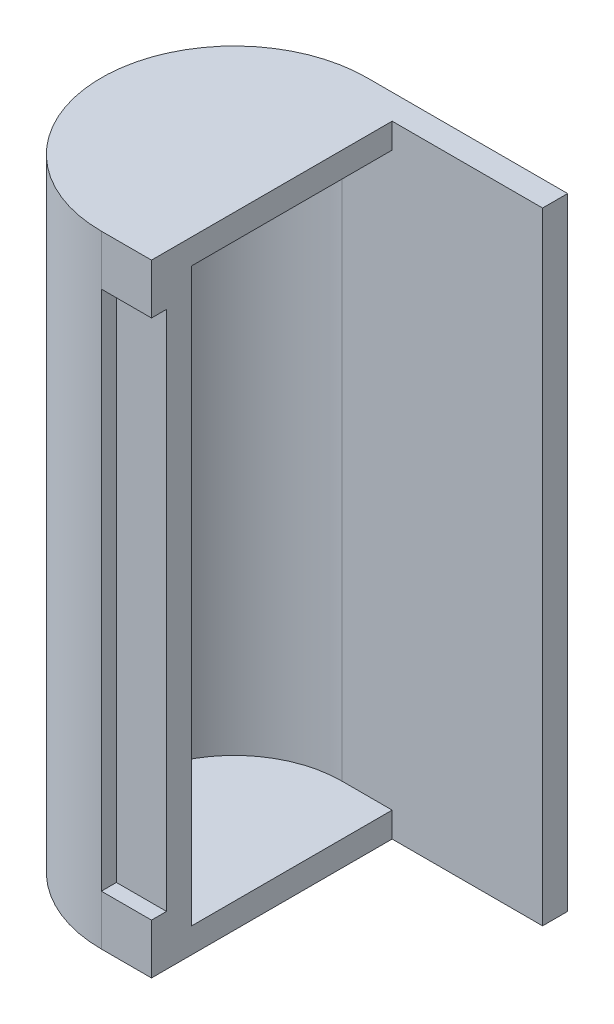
ISO-10303-21;
HEADER;
FILE_DESCRIPTION(('STEP AP214'),'2;1');
FILE_NAME('part.step','',(''),(''),'','','');
FILE_SCHEMA(('AUTOMOTIVE_DESIGN { 1 0 10303 214 1 1 1 1 }'));
ENDSEC;
DATA;
#1=APPLICATION_CONTEXT('core data for automotive mechanical design processes');
#2=APPLICATION_PROTOCOL_DEFINITION('international standard','automotive_design',2000,#1);
#3=PRODUCT_CONTEXT('',#1,'mechanical');
#4=PRODUCT('Part','Part','',(#3));
#5=PRODUCT_RELATED_PRODUCT_CATEGORY('part','',(#4));
#6=PRODUCT_DEFINITION_FORMATION('','',#4);
#7=PRODUCT_DEFINITION_CONTEXT('part definition',#1,'design');
#8=PRODUCT_DEFINITION('design','',#6,#7);
#9=PRODUCT_DEFINITION_SHAPE('','',#8);
#10=(LENGTH_UNIT() NAMED_UNIT(*) SI_UNIT(.MILLI.,.METRE.));
#11=(NAMED_UNIT(*) PLANE_ANGLE_UNIT() SI_UNIT($,.RADIAN.));
#12=(NAMED_UNIT(*) SI_UNIT($,.STERADIAN.) SOLID_ANGLE_UNIT());
#13=UNCERTAINTY_MEASURE_WITH_UNIT(LENGTH_MEASURE(1.E-05),#10,'distance_accuracy_value','');
#14=(GEOMETRIC_REPRESENTATION_CONTEXT(3) GLOBAL_UNCERTAINTY_ASSIGNED_CONTEXT((#13)) GLOBAL_UNIT_ASSIGNED_CONTEXT((#10,
#11,#12)) REPRESENTATION_CONTEXT('',''));
#15=CARTESIAN_POINT('',(0.,0.,0.));
#16=DIRECTION('',(0.,0.,1.));
#17=DIRECTION('',(1.,0.,0.));
#18=AXIS2_PLACEMENT_3D('',#15,#16,#17);
#19=CARTESIAN_POINT('',(-24.3261331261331,-109.594405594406,26.5));
#20=DIRECTION('',(0.,1.,0.));
#21=DIRECTION('',(0.,0.,1.));
#22=AXIS2_PLACEMENT_3D('',#19,#20,#21);
#23=CYLINDRICAL_SURFACE('',#22,21.5);
#24=DIRECTION('',(0.,1.,0.));
#25=VECTOR('',#24,1.);
#26=CARTESIAN_POINT('',(-24.3261331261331,-109.594405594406,48.));
#27=LINE('',#26,#25);
#28=CARTESIAN_POINT('',(-24.3261331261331,-104.594405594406,48.));
#29=VERTEX_POINT('',#28);
#30=CARTESIAN_POINT('',(-24.3261331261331,9.4055944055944,48.));
#31=VERTEX_POINT('',#30);
#32=EDGE_CURVE('E235',#29,#31,#27,.T.);
#33=ORIENTED_EDGE('',*,*,#32,.F.);
#34=CARTESIAN_POINT('',(-24.3261331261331,-104.594405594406,26.5));
#35=DIRECTION('',(0.,-1.,0.));
#36=DIRECTION('',(0.,0.,-1.));
#37=AXIS2_PLACEMENT_3D('',#34,#35,#36);
#38=CIRCLE('',#37,21.5);
#39=CARTESIAN_POINT('',(-24.3261331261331,-104.594405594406,5.));
#40=VERTEX_POINT('',#39);
#41=EDGE_CURVE('E282',#29,#40,#38,.T.);
#42=ORIENTED_EDGE('',*,*,#41,.T.);
#43=DIRECTION('',(0.,-1.,0.));
#44=VECTOR('',#43,1.);
#45=CARTESIAN_POINT('',(-24.3261331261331,14.4055944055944,5.));
#46=LINE('',#45,#44);
#47=CARTESIAN_POINT('',(-24.3261331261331,9.40559440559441,5.));
#48=VERTEX_POINT('',#47);
#49=EDGE_CURVE('E165',#48,#40,#46,.T.);
#50=ORIENTED_EDGE('',*,*,#49,.F.);
#51=CARTESIAN_POINT('',(-24.3261331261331,9.40559440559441,26.5));
#52=DIRECTION('',(0.,1.,0.));
#53=DIRECTION('',(0.,0.,1.));
#54=AXIS2_PLACEMENT_3D('',#51,#52,#53);
#55=CIRCLE('',#54,21.5);
#56=EDGE_CURVE('E181',#48,#31,#55,.T.);
#57=ORIENTED_EDGE('',*,*,#56,.T.);
#58=EDGE_LOOP('',(#33,#42,#50,#57));
#59=FACE_BOUND('',#58,.T.);
#60=ADVANCED_FACE('F37',(#59),#23,.F.);
#61=CARTESIAN_POINT('',(-24.3261331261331,14.4055944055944,45.));
#62=DIRECTION('',(-1.,0.,0.));
#63=DIRECTION('',(0.,0.,1.));
#64=AXIS2_PLACEMENT_3D('',#61,#62,#63);
#65=PLANE('',#64);
#66=DIRECTION('',(0.,-1.,0.));
#67=VECTOR('',#66,1.);
#68=CARTESIAN_POINT('',(-24.3261331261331,14.4055944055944,45.));
#69=LINE('',#68,#67);
#70=CARTESIAN_POINT('',(-24.3261331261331,9.4055944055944,45.));
#71=VERTEX_POINT('',#70);
#72=CARTESIAN_POINT('',(-24.3261331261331,-104.594405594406,45.));
#73=VERTEX_POINT('',#72);
#74=EDGE_CURVE('E217',#71,#73,#69,.T.);
#75=ORIENTED_EDGE('',*,*,#74,.T.);
#76=DIRECTION('',(0.,0.,1.));
#77=VECTOR('',#76,1.);
#78=CARTESIAN_POINT('',(-24.3261331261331,-104.594405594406,45.));
#79=LINE('',#78,#77);
#80=EDGE_CURVE('E52',#73,#29,#79,.T.);
#81=ORIENTED_EDGE('',*,*,#80,.T.);
#82=ORIENTED_EDGE('',*,*,#32,.T.);
#83=DIRECTION('',(0.,0.,-1.));
#84=VECTOR('',#83,1.);
#85=CARTESIAN_POINT('',(-24.3261331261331,9.4055944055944,45.));
#86=LINE('',#85,#84);
#87=EDGE_CURVE('E174',#31,#71,#86,.T.);
#88=ORIENTED_EDGE('',*,*,#87,.T.);
#89=EDGE_LOOP('',(#75,#81,#82,#88));
#90=FACE_BOUND('',#89,.T.);
#91=ADVANCED_FACE('F278',(#90),#65,.T.);
#92=CARTESIAN_POINT('',(0.,0.,45.));
#93=DIRECTION('',(0.,0.,1.));
#94=DIRECTION('',(1.,0.,0.));
#95=AXIS2_PLACEMENT_3D('',#92,#93,#94);
#96=PLANE('',#95);
#97=DIRECTION('',(1.,0.,0.));
#98=VECTOR('',#97,1.);
#99=CARTESIAN_POINT('',(0.,-104.594405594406,45.));
#100=LINE('',#99,#98);
#101=CARTESIAN_POINT('',(-14.3261331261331,-104.594405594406,45.));
#102=VERTEX_POINT('',#101);
#103=EDGE_CURVE('E60',#73,#102,#100,.T.);
#104=ORIENTED_EDGE('',*,*,#103,.F.);
#105=ORIENTED_EDGE('',*,*,#74,.F.);
#106=DIRECTION('',(-1.,0.,0.));
#107=VECTOR('',#106,1.);
#108=CARTESIAN_POINT('',(0.,9.4055944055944,45.));
#109=LINE('',#108,#107);
#110=CARTESIAN_POINT('',(-14.3261331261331,9.4055944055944,45.));
#111=VERTEX_POINT('',#110);
#112=EDGE_CURVE('E11',#111,#71,#109,.T.);
#113=ORIENTED_EDGE('',*,*,#112,.F.);
#114=DIRECTION('',(0.,1.,0.));
#115=VECTOR('',#114,1.);
#116=CARTESIAN_POINT('',(-14.3261331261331,14.4055944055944,45.));
#117=LINE('',#116,#115);
#118=EDGE_CURVE('E219',#102,#111,#117,.T.);
#119=ORIENTED_EDGE('',*,*,#118,.F.);
#120=EDGE_LOOP('',(#104,#105,#113,#119));
#121=FACE_BOUND('',#120,.T.);
#122=ADVANCED_FACE('F277',(#121),#96,.F.);
#123=CARTESIAN_POINT('',(-14.3261331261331,14.4055944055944,53.));
#124=DIRECTION('',(0.,0.,-1.));
#125=DIRECTION('',(-1.,0.,0.));
#126=AXIS2_PLACEMENT_3D('',#123,#124,#125);
#127=PLANE('',#126);
#128=DIRECTION('',(-1.,0.,0.));
#129=VECTOR('',#128,1.);
#130=CARTESIAN_POINT('',(-14.3261331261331,14.4055944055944,53.));
#131=LINE('',#130,#129);
#132=CARTESIAN_POINT('',(-14.3261331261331,14.4055944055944,53.));
#133=VERTEX_POINT('',#132);
#134=CARTESIAN_POINT('',(-24.3261331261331,14.4055944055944,53.));
#135=VERTEX_POINT('',#134);
#136=EDGE_CURVE('E223',#133,#135,#131,.T.);
#137=ORIENTED_EDGE('',*,*,#136,.T.);
#138=DIRECTION('',(0.,1.,0.));
#139=VECTOR('',#138,1.);
#140=CARTESIAN_POINT('',(-24.3261331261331,-109.594405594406,53.));
#141=LINE('',#140,#139);
#142=CARTESIAN_POINT('',(-24.3261331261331,4.4055944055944,53.));
#143=VERTEX_POINT('',#142);
#144=EDGE_CURVE('E232',#143,#135,#141,.T.);
#145=ORIENTED_EDGE('',*,*,#144,.F.);
#146=DIRECTION('',(1.,0.,0.));
#147=VECTOR('',#146,1.);
#148=CARTESIAN_POINT('',(-14.3261331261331,4.4055944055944,53.));
#149=LINE('',#148,#147);
#150=CARTESIAN_POINT('',(-14.3261331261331,4.4055944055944,53.));
#151=VERTEX_POINT('',#150);
#152=EDGE_CURVE('E214',#143,#151,#149,.T.);
#153=ORIENTED_EDGE('',*,*,#152,.T.);
#154=DIRECTION('',(0.,-1.,0.));
#155=VECTOR('',#154,1.);
#156=CARTESIAN_POINT('',(-14.3261331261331,14.4055944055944,53.));
#157=LINE('',#156,#155);
#158=EDGE_CURVE('E157',#133,#151,#157,.T.);
#159=ORIENTED_EDGE('',*,*,#158,.F.);
#160=EDGE_LOOP('',(#137,#145,#153,#159));
#161=FACE_BOUND('',#160,.T.);
#162=ADVANCED_FACE('F307',(#161),#127,.F.);
#163=CARTESIAN_POINT('',(-24.3261331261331,-109.594405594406,5.));
#164=DIRECTION('',(0.,1.,0.));
#165=DIRECTION('',(0.,0.,1.));
#166=AXIS2_PLACEMENT_3D('',#163,#164,#165);
#167=PLANE('',#166);
#168=DIRECTION('',(1.,0.,0.));
#169=VECTOR('',#168,1.);
#170=CARTESIAN_POINT('',(-24.3261331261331,-109.594405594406,5.));
#171=LINE('',#170,#169);
#172=CARTESIAN_POINT('',(-14.3261331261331,-109.594405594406,5.));
#173=VERTEX_POINT('',#172);
#174=CARTESIAN_POINT('',(15.6738668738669,-109.594405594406,5.));
#175=VERTEX_POINT('',#174);
#176=EDGE_CURVE('E160',#173,#175,#171,.T.);
#177=ORIENTED_EDGE('',*,*,#176,.F.);
#178=DIRECTION('',(0.,0.,-1.));
#179=VECTOR('',#178,1.);
#180=CARTESIAN_POINT('',(-14.3261331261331,-109.594405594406,53.));
#181=LINE('',#180,#179);
#182=CARTESIAN_POINT('',(-14.3261331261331,-109.594405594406,53.));
#183=VERTEX_POINT('',#182);
#184=EDGE_CURVE('E144',#183,#173,#181,.T.);
#185=ORIENTED_EDGE('',*,*,#184,.F.);
#186=DIRECTION('',(-1.,0.,0.));
#187=VECTOR('',#186,1.);
#188=CARTESIAN_POINT('',(-14.3261331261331,-109.594405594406,53.));
#189=LINE('',#188,#187);
#190=CARTESIAN_POINT('',(-24.3261331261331,-109.594405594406,53.));
#191=VERTEX_POINT('',#190);
#192=EDGE_CURVE('E226',#183,#191,#189,.T.);
#193=ORIENTED_EDGE('',*,*,#192,.T.);
#194=CARTESIAN_POINT('',(-24.3261331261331,-109.594405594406,26.5));
#195=DIRECTION('',(0.,1.,0.));
#196=DIRECTION('',(0.,0.,1.));
#197=AXIS2_PLACEMENT_3D('',#194,#195,#196);
#198=CIRCLE('',#197,26.5);
#199=CARTESIAN_POINT('',(-24.3261331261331,-109.594405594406,0.));
#200=VERTEX_POINT('',#199);
#201=EDGE_CURVE('E229',#200,#191,#198,.T.);
#202=ORIENTED_EDGE('',*,*,#201,.F.);
#203=DIRECTION('',(1.,0.,0.));
#204=VECTOR('',#203,1.);
#205=CARTESIAN_POINT('',(-24.3261331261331,-109.594405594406,0.));
#206=LINE('',#205,#204);
#207=CARTESIAN_POINT('',(15.6738668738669,-109.594405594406,0.));
#208=VERTEX_POINT('',#207);
#209=EDGE_CURVE('E249',#200,#208,#206,.T.);
#210=ORIENTED_EDGE('',*,*,#209,.T.);
#211=DIRECTION('',(0.,0.,-1.));
#212=VECTOR('',#211,1.);
#213=CARTESIAN_POINT('',(15.6738668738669,-109.594405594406,5.));
#214=LINE('',#213,#212);
#215=EDGE_CURVE('E45',#175,#208,#214,.T.);
#216=ORIENTED_EDGE('',*,*,#215,.F.);
#217=EDGE_LOOP('',(#177,#185,#193,#202,#210,#216));
#218=FACE_BOUND('',#217,.T.);
#219=ADVANCED_FACE('F39',(#218),#167,.F.);
#220=CARTESIAN_POINT('',(15.6738668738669,14.4055944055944,5.));
#221=DIRECTION('',(-1.,0.,0.));
#222=DIRECTION('',(0.,-1.,0.));
#223=AXIS2_PLACEMENT_3D('',#220,#221,#222);
#224=PLANE('',#223);
#225=DIRECTION('',(0.,1.,0.));
#226=VECTOR('',#225,1.);
#227=CARTESIAN_POINT('',(15.6738668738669,14.4055944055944,0.));
#228=LINE('',#227,#226);
#229=CARTESIAN_POINT('',(15.6738668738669,14.4055944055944,0.));
#230=VERTEX_POINT('',#229);
#231=EDGE_CURVE('E251',#208,#230,#228,.T.);
#232=ORIENTED_EDGE('',*,*,#231,.T.);
#233=DIRECTION('',(0.,0.,-1.));
#234=VECTOR('',#233,1.);
#235=CARTESIAN_POINT('',(15.6738668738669,14.4055944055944,5.));
#236=LINE('',#235,#234);
#237=CARTESIAN_POINT('',(15.6738668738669,14.4055944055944,5.));
#238=VERTEX_POINT('',#237);
#239=EDGE_CURVE('E247',#238,#230,#236,.T.);
#240=ORIENTED_EDGE('',*,*,#239,.F.);
#241=DIRECTION('',(0.,1.,0.));
#242=VECTOR('',#241,1.);
#243=CARTESIAN_POINT('',(15.6738668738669,14.4055944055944,5.));
#244=LINE('',#243,#242);
#245=EDGE_CURVE('E164',#175,#238,#244,.T.);
#246=ORIENTED_EDGE('',*,*,#245,.F.);
#247=ORIENTED_EDGE('',*,*,#215,.T.);
#248=EDGE_LOOP('',(#232,#240,#246,#247));
#249=FACE_BOUND('',#248,.T.);
#250=ADVANCED_FACE('F257',(#249),#224,.F.);
#251=CARTESIAN_POINT('',(-24.3261331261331,14.4055944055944,5.));
#252=DIRECTION('',(0.,-1.,0.));
#253=DIRECTION('',(0.,0.,-1.));
#254=AXIS2_PLACEMENT_3D('',#251,#252,#253);
#255=PLANE('',#254);
#256=DIRECTION('',(-1.,0.,0.));
#257=VECTOR('',#256,1.);
#258=CARTESIAN_POINT('',(-24.3261331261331,14.4055944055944,0.));
#259=LINE('',#258,#257);
#260=CARTESIAN_POINT('',(-24.3261331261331,14.4055944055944,0.));
#261=VERTEX_POINT('',#260);
#262=EDGE_CURVE('E241',#230,#261,#259,.T.);
#263=ORIENTED_EDGE('',*,*,#262,.T.);
#264=CARTESIAN_POINT('',(-24.3261331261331,14.4055944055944,26.5));
#265=DIRECTION('',(0.,1.,0.));
#266=DIRECTION('',(0.,0.,1.));
#267=AXIS2_PLACEMENT_3D('',#264,#265,#266);
#268=CIRCLE('',#267,26.5);
#269=EDGE_CURVE('E228',#261,#135,#268,.T.);
#270=ORIENTED_EDGE('',*,*,#269,.T.);
#271=ORIENTED_EDGE('',*,*,#136,.F.);
#272=DIRECTION('',(0.,0.,1.));
#273=VECTOR('',#272,1.);
#274=CARTESIAN_POINT('',(-14.3261331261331,14.4055944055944,53.));
#275=LINE('',#274,#273);
#276=CARTESIAN_POINT('',(-14.3261331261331,14.4055944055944,5.));
#277=VERTEX_POINT('',#276);
#278=EDGE_CURVE('E156',#277,#133,#275,.T.);
#279=ORIENTED_EDGE('',*,*,#278,.F.);
#280=DIRECTION('',(-1.,0.,0.));
#281=VECTOR('',#280,1.);
#282=CARTESIAN_POINT('',(-24.3261331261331,14.4055944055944,5.));
#283=LINE('',#282,#281);
#284=EDGE_CURVE('E244',#238,#277,#283,.T.);
#285=ORIENTED_EDGE('',*,*,#284,.F.);
#286=ORIENTED_EDGE('',*,*,#239,.T.);
#287=EDGE_LOOP('',(#263,#270,#271,#279,#285,#286));
#288=FACE_BOUND('',#287,.T.);
#289=ADVANCED_FACE('F267',(#288),#255,.F.);
#290=CARTESIAN_POINT('',(0.,0.,5.));
#291=DIRECTION('',(0.,0.,1.));
#292=DIRECTION('',(1.,0.,0.));
#293=AXIS2_PLACEMENT_3D('',#290,#291,#292);
#294=PLANE('',#293);
#295=DIRECTION('',(0.,1.,0.));
#296=VECTOR('',#295,1.);
#297=CARTESIAN_POINT('',(-14.3261331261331,0.,5.));
#298=LINE('',#297,#296);
#299=CARTESIAN_POINT('',(-14.3261331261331,-104.594405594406,5.));
#300=VERTEX_POINT('',#299);
#301=EDGE_CURVE('E149',#173,#300,#298,.T.);
#302=ORIENTED_EDGE('',*,*,#301,.F.);
#303=ORIENTED_EDGE('',*,*,#176,.T.);
#304=ORIENTED_EDGE('',*,*,#245,.T.);
#305=ORIENTED_EDGE('',*,*,#284,.T.);
#306=DIRECTION('',(0.,1.,0.));
#307=VECTOR('',#306,1.);
#308=CARTESIAN_POINT('',(-14.3261331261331,0.,5.));
#309=LINE('',#308,#307);
#310=CARTESIAN_POINT('',(-14.3261331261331,9.4055944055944,5.));
#311=VERTEX_POINT('',#310);
#312=EDGE_CURVE('E187',#311,#277,#309,.T.);
#313=ORIENTED_EDGE('',*,*,#312,.F.);
#314=DIRECTION('',(-1.,0.,0.));
#315=VECTOR('',#314,1.);
#316=CARTESIAN_POINT('',(0.,9.4055944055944,5.));
#317=LINE('',#316,#315);
#318=EDGE_CURVE('E184',#311,#48,#317,.T.);
#319=ORIENTED_EDGE('',*,*,#318,.T.);
#320=ORIENTED_EDGE('',*,*,#49,.T.);
#321=DIRECTION('',(1.,0.,0.));
#322=VECTOR('',#321,1.);
#323=CARTESIAN_POINT('',(0.,-104.594405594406,5.));
#324=LINE('',#323,#322);
#325=EDGE_CURVE('E170',#40,#300,#324,.T.);
#326=ORIENTED_EDGE('',*,*,#325,.T.);
#327=EDGE_LOOP('',(#302,#303,#304,#305,#313,#319,#320,#326));
#328=FACE_BOUND('',#327,.T.);
#329=ADVANCED_FACE('F167',(#328),#294,.T.);
#330=CARTESIAN_POINT('',(0.,0.,0.));
#331=DIRECTION('',(0.,0.,1.));
#332=DIRECTION('',(1.,0.,0.));
#333=AXIS2_PLACEMENT_3D('',#330,#331,#332);
#334=PLANE('',#333);
#335=ORIENTED_EDGE('',*,*,#231,.F.);
#336=ORIENTED_EDGE('',*,*,#209,.F.);
#337=DIRECTION('',(0.,-1.,0.));
#338=VECTOR('',#337,1.);
#339=CARTESIAN_POINT('',(-24.3261331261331,14.4055944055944,0.));
#340=LINE('',#339,#338);
#341=EDGE_CURVE('E237',#261,#200,#340,.T.);
#342=ORIENTED_EDGE('',*,*,#341,.F.);
#343=ORIENTED_EDGE('',*,*,#262,.F.);
#344=EDGE_LOOP('',(#335,#336,#342,#343));
#345=FACE_BOUND('',#344,.T.);
#346=ADVANCED_FACE('F262',(#345),#334,.F.);
#347=CARTESIAN_POINT('',(-24.3261331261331,-109.594405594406,26.5));
#348=DIRECTION('',(0.,1.,0.));
#349=DIRECTION('',(0.,0.,1.));
#350=AXIS2_PLACEMENT_3D('',#347,#348,#349);
#351=CYLINDRICAL_SURFACE('',#350,26.5);
#352=CARTESIAN_POINT('',(-24.3261331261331,-99.5944055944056,53.));
#353=VERTEX_POINT('',#352);
#354=EDGE_CURVE('E238',#191,#353,#141,.T.);
#355=ORIENTED_EDGE('',*,*,#354,.T.);
#356=EDGE_CURVE('E240',#353,#143,#141,.T.);
#357=ORIENTED_EDGE('',*,*,#356,.T.);
#358=ORIENTED_EDGE('',*,*,#144,.T.);
#359=ORIENTED_EDGE('',*,*,#269,.F.);
#360=ORIENTED_EDGE('',*,*,#341,.T.);
#361=ORIENTED_EDGE('',*,*,#201,.T.);
#362=EDGE_LOOP('',(#355,#357,#358,#359,#360,#361));
#363=FACE_BOUND('',#362,.T.);
#364=ADVANCED_FACE('F296',(#363),#351,.T.);
#365=ORIENTED_EDGE('',*,*,#192,.F.);
#366=CARTESIAN_POINT('',(-14.3261331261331,-99.5944055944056,53.));
#367=VERTEX_POINT('',#366);
#368=EDGE_CURVE('E153',#367,#183,#157,.T.);
#369=ORIENTED_EDGE('',*,*,#368,.F.);
#370=DIRECTION('',(-1.,0.,0.));
#371=VECTOR('',#370,1.);
#372=CARTESIAN_POINT('',(-14.3261331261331,-99.5944055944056,53.));
#373=LINE('',#372,#371);
#374=EDGE_CURVE('E204',#367,#353,#373,.T.);
#375=ORIENTED_EDGE('',*,*,#374,.T.);
#376=ORIENTED_EDGE('',*,*,#354,.F.);
#377=EDGE_LOOP('',(#365,#369,#375,#376));
#378=FACE_BOUND('',#377,.T.);
#379=ADVANCED_FACE('F312',(#378),#127,.F.);
#380=CARTESIAN_POINT('',(-14.3261331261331,0.,0.));
#381=DIRECTION('',(1.,0.,0.));
#382=DIRECTION('',(0.,0.,-1.));
#383=AXIS2_PLACEMENT_3D('',#380,#381,#382);
#384=PLANE('',#383);
#385=ORIENTED_EDGE('',*,*,#184,.T.);
#386=ORIENTED_EDGE('',*,*,#301,.T.);
#387=DIRECTION('',(0.,0.,1.));
#388=VECTOR('',#387,1.);
#389=CARTESIAN_POINT('',(-14.3261331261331,-104.594405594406,53.));
#390=LINE('',#389,#388);
#391=EDGE_CURVE('E286',#300,#102,#390,.T.);
#392=ORIENTED_EDGE('',*,*,#391,.T.);
#393=ORIENTED_EDGE('',*,*,#118,.T.);
#394=DIRECTION('',(0.,0.,-1.));
#395=VECTOR('',#394,1.);
#396=CARTESIAN_POINT('',(-14.3261331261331,9.4055944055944,53.));
#397=LINE('',#396,#395);
#398=EDGE_CURVE('E171',#111,#311,#397,.T.);
#399=ORIENTED_EDGE('',*,*,#398,.T.);
#400=ORIENTED_EDGE('',*,*,#312,.T.);
#401=ORIENTED_EDGE('',*,*,#278,.T.);
#402=ORIENTED_EDGE('',*,*,#158,.T.);
#403=DIRECTION('',(0.,0.,1.));
#404=VECTOR('',#403,1.);
#405=CARTESIAN_POINT('',(-14.3261331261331,4.4055944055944,50.));
#406=LINE('',#405,#404);
#407=CARTESIAN_POINT('',(-14.3261331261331,4.4055944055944,50.));
#408=VERTEX_POINT('',#407);
#409=EDGE_CURVE('E205',#408,#151,#406,.T.);
#410=ORIENTED_EDGE('',*,*,#409,.F.);
#411=DIRECTION('',(0.,1.,0.));
#412=VECTOR('',#411,1.);
#413=CARTESIAN_POINT('',(-14.3261331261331,4.4055944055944,50.));
#414=LINE('',#413,#412);
#415=CARTESIAN_POINT('',(-14.3261331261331,-99.5944055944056,50.));
#416=VERTEX_POINT('',#415);
#417=EDGE_CURVE('E195',#416,#408,#414,.T.);
#418=ORIENTED_EDGE('',*,*,#417,.F.);
#419=DIRECTION('',(0.,0.,1.));
#420=VECTOR('',#419,1.);
#421=CARTESIAN_POINT('',(-14.3261331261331,-99.5944055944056,50.));
#422=LINE('',#421,#420);
#423=EDGE_CURVE('E208',#416,#367,#422,.T.);
#424=ORIENTED_EDGE('',*,*,#423,.T.);
#425=ORIENTED_EDGE('',*,*,#368,.T.);
#426=EDGE_LOOP('',(#385,#386,#392,#393,#399,#400,#401,#402,#410,#418,#424,#425));
#427=FACE_BOUND('',#426,.T.);
#428=ADVANCED_FACE('F146',(#427),#384,.T.);
#429=CARTESIAN_POINT('',(-24.3261331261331,4.4055944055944,50.));
#430=DIRECTION('',(-1.,0.,0.));
#431=DIRECTION('',(0.,0.,1.));
#432=AXIS2_PLACEMENT_3D('',#429,#430,#431);
#433=PLANE('',#432);
#434=DIRECTION('',(0.,0.,1.));
#435=VECTOR('',#434,1.);
#436=CARTESIAN_POINT('',(-24.3261331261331,-99.5944055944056,50.));
#437=LINE('',#436,#435);
#438=CARTESIAN_POINT('',(-24.3261331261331,-99.5944055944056,50.));
#439=VERTEX_POINT('',#438);
#440=EDGE_CURVE('E200',#439,#353,#437,.T.);
#441=ORIENTED_EDGE('',*,*,#440,.F.);
#442=DIRECTION('',(0.,-1.,0.));
#443=VECTOR('',#442,1.);
#444=CARTESIAN_POINT('',(-24.3261331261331,4.4055944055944,50.));
#445=LINE('',#444,#443);
#446=CARTESIAN_POINT('',(-24.3261331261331,4.4055944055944,50.));
#447=VERTEX_POINT('',#446);
#448=EDGE_CURVE('E190',#447,#439,#445,.T.);
#449=ORIENTED_EDGE('',*,*,#448,.F.);
#450=DIRECTION('',(0.,0.,1.));
#451=VECTOR('',#450,1.);
#452=CARTESIAN_POINT('',(-24.3261331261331,4.4055944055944,50.));
#453=LINE('',#452,#451);
#454=EDGE_CURVE('E201',#447,#143,#453,.T.);
#455=ORIENTED_EDGE('',*,*,#454,.T.);
#456=ORIENTED_EDGE('',*,*,#356,.F.);
#457=EDGE_LOOP('',(#441,#449,#455,#456));
#458=FACE_BOUND('',#457,.T.);
#459=ADVANCED_FACE('F324',(#458),#433,.F.);
#460=CARTESIAN_POINT('',(-24.3261331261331,4.4055944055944,50.));
#461=DIRECTION('',(0.,1.,0.));
#462=DIRECTION('',(0.,0.,1.));
#463=AXIS2_PLACEMENT_3D('',#460,#461,#462);
#464=PLANE('',#463);
#465=ORIENTED_EDGE('',*,*,#454,.F.);
#466=DIRECTION('',(-1.,0.,0.));
#467=VECTOR('',#466,1.);
#468=CARTESIAN_POINT('',(-24.3261331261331,4.4055944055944,50.));
#469=LINE('',#468,#467);
#470=EDGE_CURVE('E197',#408,#447,#469,.T.);
#471=ORIENTED_EDGE('',*,*,#470,.F.);
#472=ORIENTED_EDGE('',*,*,#409,.T.);
#473=ORIENTED_EDGE('',*,*,#152,.F.);
#474=EDGE_LOOP('',(#465,#471,#472,#473));
#475=FACE_BOUND('',#474,.T.);
#476=ADVANCED_FACE('F335',(#475),#464,.F.);
#477=CARTESIAN_POINT('',(-24.3261331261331,-99.5944055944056,50.));
#478=DIRECTION('',(0.,-1.,0.));
#479=DIRECTION('',(0.,0.,-1.));
#480=AXIS2_PLACEMENT_3D('',#477,#478,#479);
#481=PLANE('',#480);
#482=ORIENTED_EDGE('',*,*,#423,.F.);
#483=DIRECTION('',(1.,0.,0.));
#484=VECTOR('',#483,1.);
#485=CARTESIAN_POINT('',(-24.3261331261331,-99.5944055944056,50.));
#486=LINE('',#485,#484);
#487=EDGE_CURVE('E193',#439,#416,#486,.T.);
#488=ORIENTED_EDGE('',*,*,#487,.F.);
#489=ORIENTED_EDGE('',*,*,#440,.T.);
#490=ORIENTED_EDGE('',*,*,#374,.F.);
#491=EDGE_LOOP('',(#482,#488,#489,#490));
#492=FACE_BOUND('',#491,.T.);
#493=ADVANCED_FACE('F342',(#492),#481,.F.);
#494=CARTESIAN_POINT('',(0.,0.,50.));
#495=DIRECTION('',(0.,0.,1.));
#496=DIRECTION('',(1.,0.,0.));
#497=AXIS2_PLACEMENT_3D('',#494,#495,#496);
#498=PLANE('',#497);
#499=ORIENTED_EDGE('',*,*,#448,.T.);
#500=ORIENTED_EDGE('',*,*,#487,.T.);
#501=ORIENTED_EDGE('',*,*,#417,.T.);
#502=ORIENTED_EDGE('',*,*,#470,.T.);
#503=EDGE_LOOP('',(#499,#500,#501,#502));
#504=FACE_BOUND('',#503,.T.);
#505=ADVANCED_FACE('F338',(#504),#498,.T.);
#506=CARTESIAN_POINT('',(-24.3261331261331,9.4055944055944,26.5));
#507=DIRECTION('',(0.,1.,0.));
#508=DIRECTION('',(0.,0.,1.));
#509=AXIS2_PLACEMENT_3D('',#506,#507,#508);
#510=PLANE('',#509);
#511=ORIENTED_EDGE('',*,*,#318,.F.);
#512=ORIENTED_EDGE('',*,*,#398,.F.);
#513=ORIENTED_EDGE('',*,*,#112,.T.);
#514=ORIENTED_EDGE('',*,*,#87,.F.);
#515=ORIENTED_EDGE('',*,*,#56,.F.);
#516=EDGE_LOOP('',(#511,#512,#513,#514,#515));
#517=FACE_BOUND('',#516,.T.);
#518=ADVANCED_FACE('F275',(#517),#510,.F.);
#519=CARTESIAN_POINT('',(-24.3261331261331,-104.594405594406,26.5));
#520=DIRECTION('',(0.,-1.,0.));
#521=DIRECTION('',(0.,0.,-1.));
#522=AXIS2_PLACEMENT_3D('',#519,#520,#521);
#523=PLANE('',#522);
#524=ORIENTED_EDGE('',*,*,#80,.F.);
#525=ORIENTED_EDGE('',*,*,#103,.T.);
#526=ORIENTED_EDGE('',*,*,#391,.F.);
#527=ORIENTED_EDGE('',*,*,#325,.F.);
#528=ORIENTED_EDGE('',*,*,#41,.F.);
#529=EDGE_LOOP('',(#524,#525,#526,#527,#528));
#530=FACE_BOUND('',#529,.T.);
#531=ADVANCED_FACE('F281',(#530),#523,.F.);
#532=CLOSED_SHELL('',(#60,#91,#122,#162,#219,#250,#289,#329,#346,#364,#379,#428,#459,#476,#493,
#505,#518,#531));
#533=MANIFOLD_SOLID_BREP('B2',#532);
#534=ADVANCED_BREP_SHAPE_REPRESENTATION('',(#18,#533),#14);
#535=SHAPE_DEFINITION_REPRESENTATION(#9,#534);
ENDSEC;
END-ISO-10303-21;
